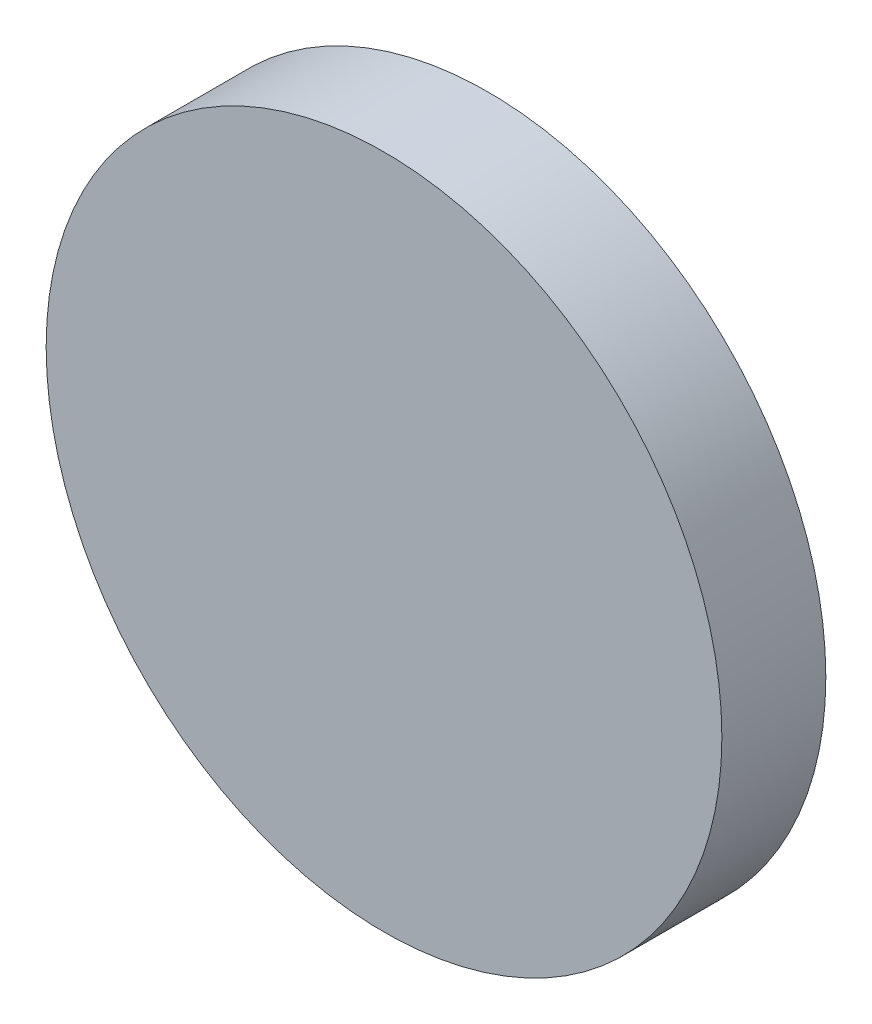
from build123d import *

# Parameters (mm, degrees)
ESQUISSE1_R          = 6.5
BASE_EXTRUSION_DEPTH = 2


with BuildPart() as part:
    # Esquisse1 → Base-Extrusion (new body)
    with BuildSketch(Plane.XY):
        Circle(ESQUISSE1_R)
    extrude(amount=BASE_EXTRUSION_DEPTH)


solid = part.part
